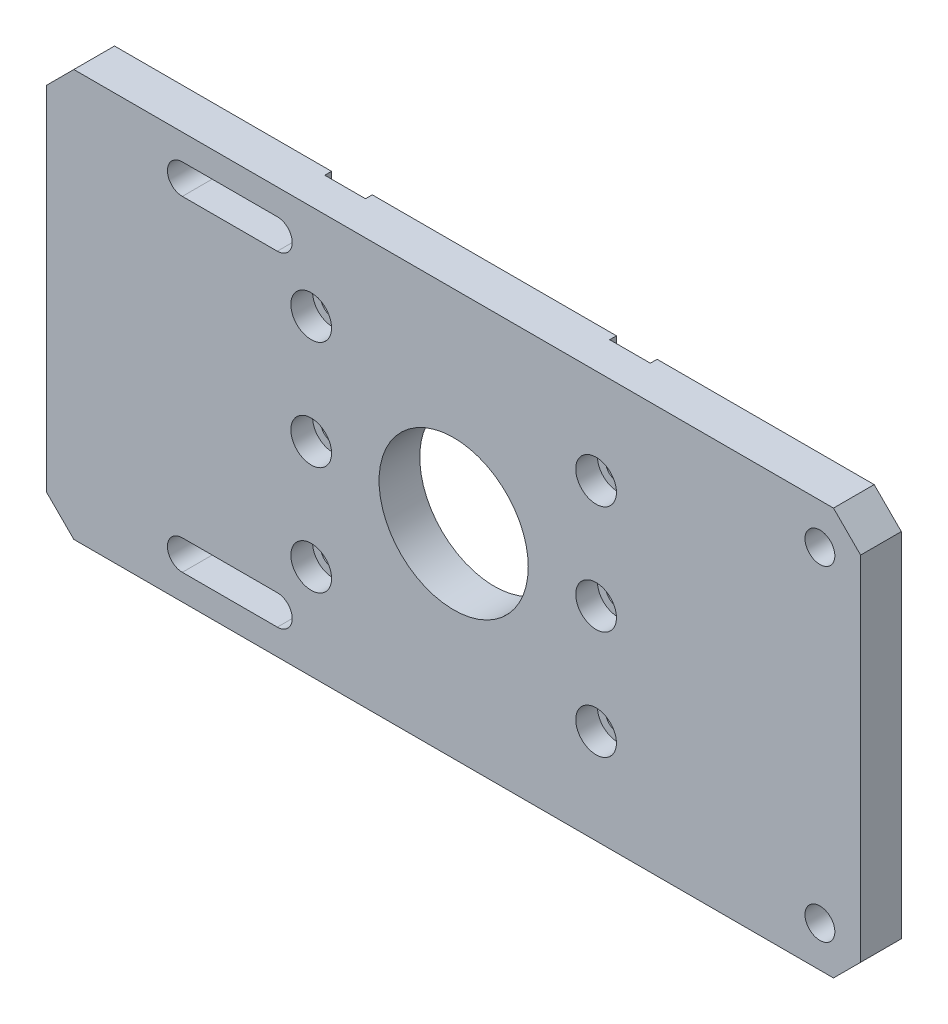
from build123d import *

# Parameters (mm, degrees)
ESQUISSE1_R                                     = 27.5
EXTRUSION1_DEPTH                                = 15
ESQUISSE2_R                                     = 5.5
ENL_V_MAT_EXTRU_1_DEPTH                         = 169.374582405
CHAMBRAGE_POUR_VIS_T_TE_CYLINDRIQUE_D           = 9
CHAMBRAGE_POUR_VIS_T_TE_CYLINDRIQUE_CBORE_D     = 15
CHAMBRAGE_POUR_VIS_T_TE_CYLINDRIQUE_CBORE_DEPTH = 8
ENL_V_MAT_EXTRU_2_DEPTH                         = 169.374582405
ENL_V_MAT_EXTRU_2_DEPTH_BACK                    = 169.374582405
ESQUISSE5_W                                     = 15
ESQUISSE5_H                                     = 10


with BuildPart() as part:
    # Esquisse1 → Extrusion1 (new body)
    with BuildSketch(Plane.XY):
        Polygon((140, 75), (150, 65), (150, -65), (140, -75), (-140, -75), (-150, -65), (-150, 65), (-140, 75), align=None)
        Circle(ESQUISSE1_R, mode=Mode.SUBTRACT)
    extrude(amount=EXTRUSION1_DEPTH)

    # Esquisse2 → Enl_v. mat.-Extru.1 (cut, through all)
    with BuildSketch(Plane.XY.offset(15)):
        with Locations((135, 60)):
            Circle(ESQUISSE2_R)
        with Locations((135, -60)):
            Circle(ESQUISSE2_R)
        with BuildLine():
            Line((-65, -54.5), (-100, -54.5))
            ThreePointArc((-100, -54.5), (-105.5, -60), (-100, -65.5))
            Line((-100, -65.5), (-65, -65.5))
            ThreePointArc((-65, -65.5), (-59.5, -60), (-65, -54.5))
        make_face()
        with BuildLine():
            Line((-100, 65.5), (-65, 65.5))
            ThreePointArc((-65, 65.5), (-59.5, 60), (-65, 54.5))
            Line((-65, 54.5), (-100, 54.5))
            ThreePointArc((-100, 54.5), (-105.5, 60), (-100, 65.5))
        make_face()
    extrude(amount=-ENL_V_MAT_EXTRU_1_DEPTH, mode=Mode.SUBTRACT)

    # Chambrage pour vis _ t_te cylindrique (through all)
    with Locations(Plane.XY.offset(15)):
        with Locations((52.5, 40), (-52.5, 40), (52.5, 0), (-52.5, 0), (52.5, -40), (-52.5, -40)):
            CounterBoreHole(CHAMBRAGE_POUR_VIS_T_TE_CYLINDRIQUE_D / 2, CHAMBRAGE_POUR_VIS_T_TE_CYLINDRIQUE_CBORE_D / 2, CHAMBRAGE_POUR_VIS_T_TE_CYLINDRIQUE_CBORE_DEPTH)

    # Esquisse5 → Enl_v. mat.-Extru.2 (cut, two sides: drawn at the far end of the back side and taken through both)
    with BuildSketch(Plane(origin=(0, 0, 0), x_dir=(1, 0, 0), z_dir=(0, 1, 0)).offset(-ENL_V_MAT_EXTRU_2_DEPTH_BACK)):
        with Locations((-52.5, 2.5)):
            Rectangle(ESQUISSE5_W, ESQUISSE5_H)
        with Locations((52.5, 2.5)):
            Rectangle(ESQUISSE5_W, ESQUISSE5_H)
    extrude(amount=ENL_V_MAT_EXTRU_2_DEPTH + ENL_V_MAT_EXTRU_2_DEPTH_BACK, mode=Mode.SUBTRACT)


solid = part.part
